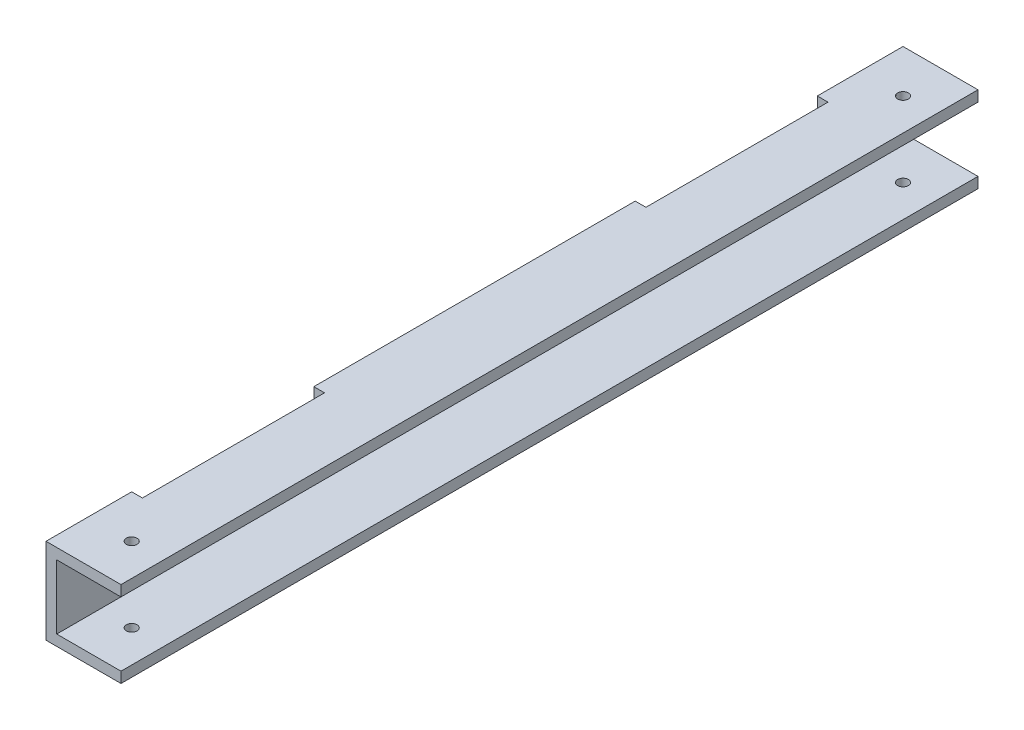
from build123d import *

# Parameters (mm, degrees)
EXTRUDE_1_DEPTH     = 254
SKETCH_2_R          = 1.5875
SKETCH_2_W          = 3.175
SKETCH_2_H          = 53.975
CUT_EXTRUDE_1_DEPTH = 25.4
SKETCH_3_R          = 1.5875
CUT_EXTRUDE_2_DEPTH = 5.08


with BuildPart() as part:
    # Sketch 1 → Extrude 1 (new body)
    with BuildSketch(Plane.XY):
        Polygon((11.1125, 9.525), (11.1125, 12.7), (-11.1125, 12.7), (-11.1125, -12.7), (11.1125, -12.7), (11.1125, -9.525), (-7.9375, -9.525), (-7.9375, 9.525), align=None)
    extrude(amount=EXTRUDE_1_DEPTH)

    # Sketch 2 → Cut-Extrude 1 (cut)
    with BuildSketch(Plane(origin=(0, 12.7, 0), x_dir=(1, 0, 0), z_dir=(0, 1, 0))):
        with Locations(Location((1.5875, -241.3, 0), (0, 0, 270))):
            Circle(SKETCH_2_R)
        with Locations(Location((1.5875, -12.7, 0), (0, 0, 270))):
            Circle(SKETCH_2_R)
        with Locations((-9.525, -52.3875)):
            Rectangle(SKETCH_2_W, SKETCH_2_H)
        with Locations((-9.525, -201.6125)):
            Rectangle(SKETCH_2_W, SKETCH_2_H)
    extrude(amount=-CUT_EXTRUDE_1_DEPTH, mode=Mode.SUBTRACT)

    # Sketch 3 → Cut-Extrude 2 (cut)
    with BuildSketch(Plane.ZY.offset(11.1125)):
        with Locations((12.7, 0)):
            Circle(SKETCH_3_R)
        with Locations((92.075, 0)):
            Circle(SKETCH_3_R)
        with Locations(Location((241.3, 0, 0), (0, 0, 270))):
            Circle(SKETCH_3_R)
        with Locations(Location((161.925, 0, 0), (0, 0, 270))):
            Circle(SKETCH_3_R)
    extrude(amount=-CUT_EXTRUDE_2_DEPTH, mode=Mode.SUBTRACT)


solid = part.part
